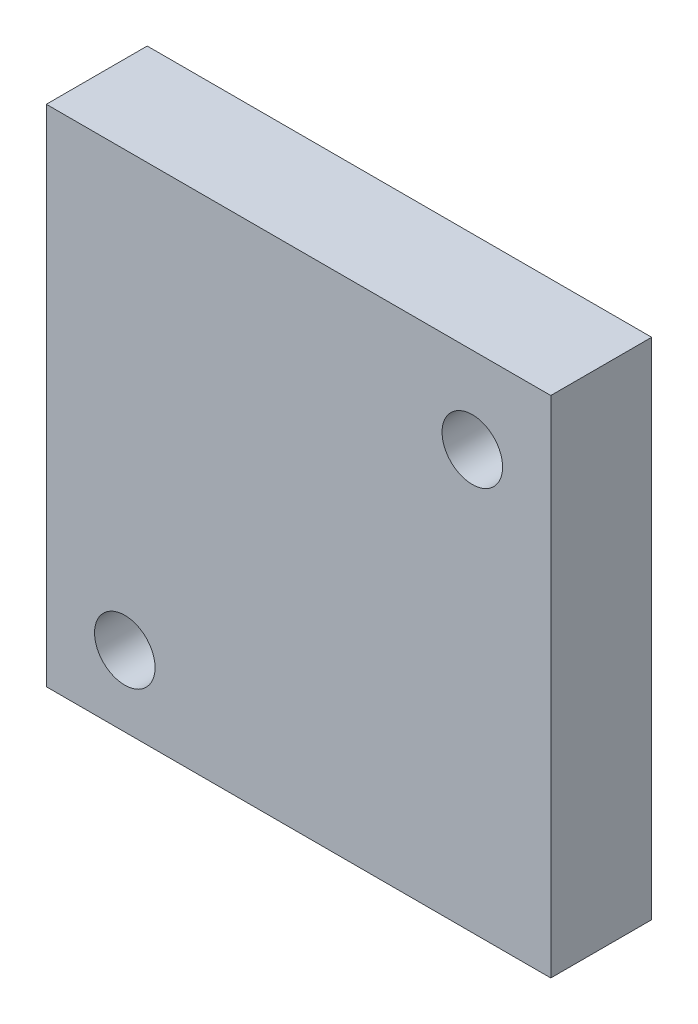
from build123d import *

# Parameters (mm, degrees)
SKETCH1_W                  = 100
SKETCH1_H                  = 100
EXTRUDE1_DEPTH             = 20
F_12_0_12_DIAMETER_HOLE1_D = 12


with BuildPart() as part:
    # Sketch1 → Extrude1 (new body)
    with BuildSketch(Plane.XY):
        Rectangle(SKETCH1_W, SKETCH1_H)
    extrude(amount=EXTRUDE1_DEPTH)

    # 12.0 _12_ Diameter Hole1 (through all)
    with Locations(Plane(origin=(-34.445074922, -35.947712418, 20), x_dir=(1, 0, 0), z_dir=(0, 0, 1))):
        with Locations((0, 0), (68.890149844, 68.890149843)):
            Hole(F_12_0_12_DIAMETER_HOLE1_D / 2)


solid = part.part
